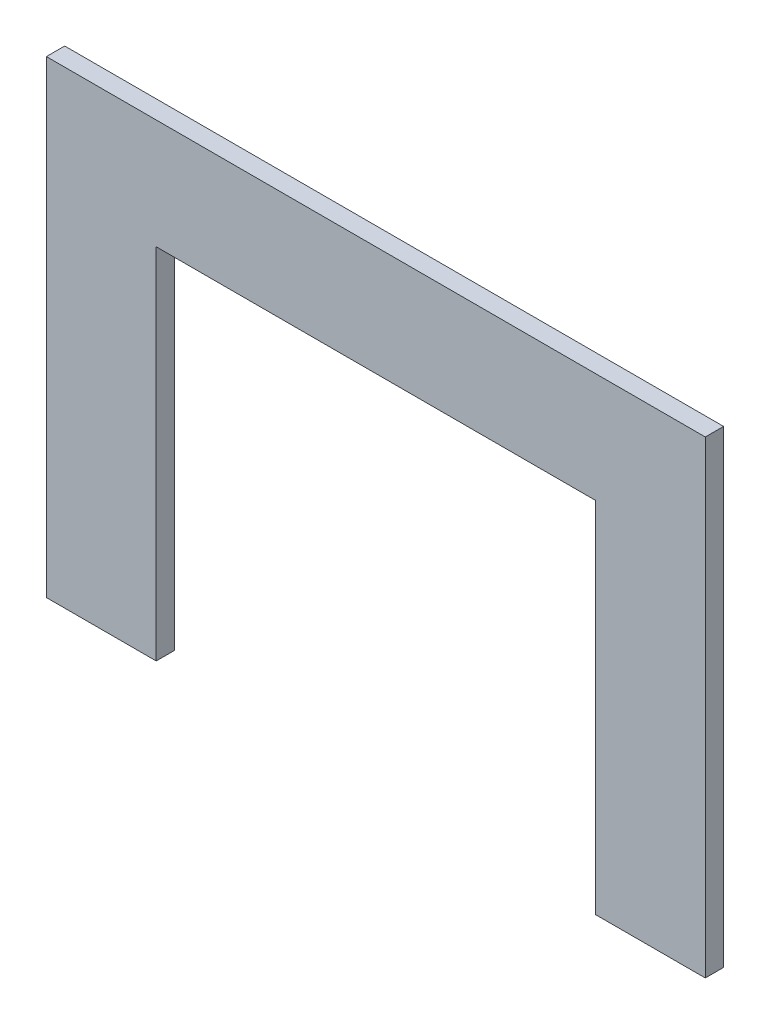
from build123d import *

# Parameters (mm, degrees)
EXTRUSION1_DEPTH = 5


with BuildPart() as part:
    # Esquisse1 → Extrusion1 (new body)
    with BuildSketch(Plane.XY):
        Polygon((60, -64), (90, -64), (90, 64), (-90, 64), (-90, -64), (-60, -64), (-60, 34), (60, 34), align=None)
    extrude(amount=EXTRUSION1_DEPTH)


solid = part.part
